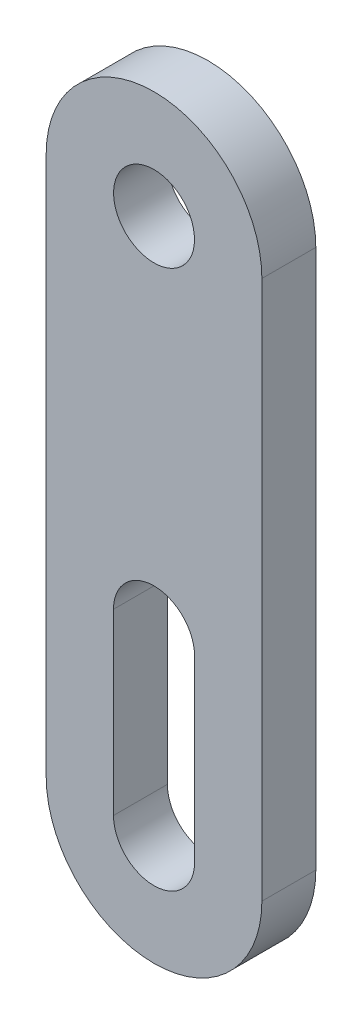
from build123d import *

# Parameters (mm, degrees)
SKETCH1_R          = 2.38125
BASE_EXTRUDE_DEPTH = 3.175


with BuildPart() as part:
    # Sketch1 → Base-Extrude (new body)
    with BuildSketch(Plane.XY):
        with BuildLine():
            Line((0, 6.35), (0, 38.1))
            ThreePointArc((0, 38.1), (6.35, 44.45), (12.7, 38.1))
            Line((12.7, 38.1), (12.7, 6.35))
            ThreePointArc((12.7, 6.35), (6.35, 0), (0, 6.35))
        make_face()
        with Locations((6.35, 38.1)):
            Circle(SKETCH1_R, mode=Mode.SUBTRACT)
        with BuildLine():
            Line((8.7376, 6.35), (8.7376, 16.8656))
            ThreePointArc((8.7376, 16.8656), (6.35, 19.2532), (3.9624, 16.8656))
            Line((3.9624, 16.8656), (3.9624, 6.35))
            ThreePointArc((3.9624, 6.35), (6.35, 3.9624), (8.7376, 6.35))
        make_face(mode=Mode.SUBTRACT)
    extrude(amount=BASE_EXTRUDE_DEPTH)


solid = part.part
